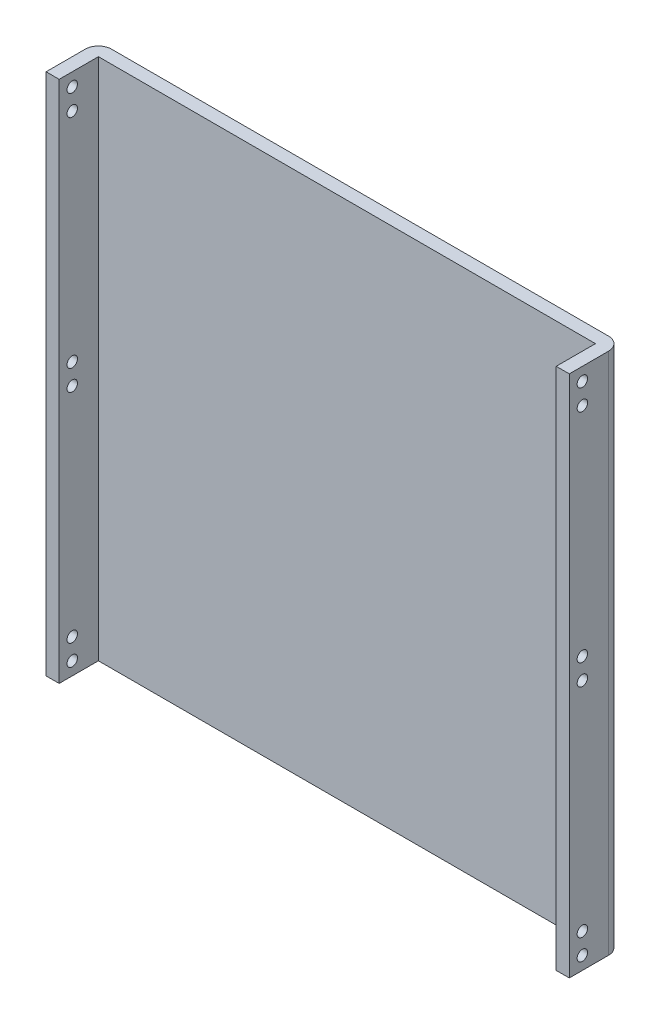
from build123d import *

# Parameters (mm, degrees)
BOSS_EXTRUDE1_DEPTH = 100
SKETCH4_R           = 2
CUT_EXTRUDE1_DEPTH  = 214


with BuildPart() as part:
    # Sketch3 → Boss-Extrude1 (new, symmetric)
    with BuildSketch(Plane(origin=(0, 0, 0), x_dir=(1, 0, 0), z_dir=(0, 1, 0))):
        with BuildLine():
            Line((95, 0), (-95, 0))
            ThreePointArc((-95, 0), (-98.535533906, -1.464466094), (-100, -5))
            Line((-100, -5), (-100, -20))
            Line((-100, -20), (-95, -20))
            Line((-95, -20), (-95, -5))
            Line((-95, -5), (95, -5))
            Line((95, -5), (95, -20))
            Line((95, -20), (100, -20))
            Line((100, -20), (100, -5))
            ThreePointArc((100, -5), (98.535533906, -1.464466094), (95, 0))
        make_face()
    extrude(amount=BOSS_EXTRUDE1_DEPTH, both=True)

    # Sketch4 → Cut-Extrude1 (cut)
    with BuildSketch(Plane.ZY.offset(100)):
        with Locations((15, 95)):
            Circle(SKETCH4_R)
        with Locations((15, 87)):
            Circle(SKETCH4_R)
        with Locations((15, 4)):
            Circle(SKETCH4_R)
        with Locations((15, -4)):
            Circle(SKETCH4_R)
        with Locations((15, -95)):
            Circle(SKETCH4_R)
        with Locations((15, -87)):
            Circle(SKETCH4_R)
    extrude(amount=-CUT_EXTRUDE1_DEPTH, mode=Mode.SUBTRACT)


solid = part.part
